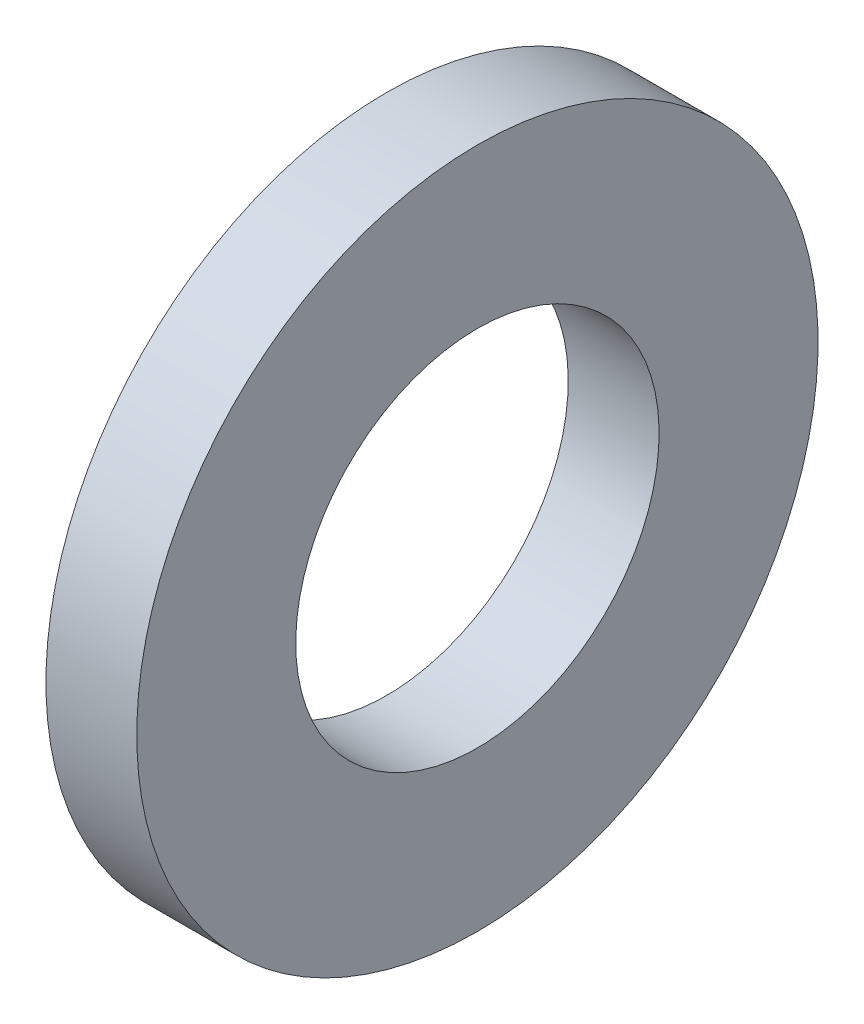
from build123d import *

# Parameters (mm, degrees)
ESQUISSE1_W = 1.6
ESQUISSE1_H = 2.8


with BuildPart() as part:
    # Esquisse1 → R_volution1 (revolve)
    with BuildSketch(Plane.XY):
        with Locations((0.8, 4.6)):
            Rectangle(ESQUISSE1_W, ESQUISSE1_H)
    revolve(axis=Axis((1.6, 0, 0), (-1, 0, 0)))


solid = part.part
